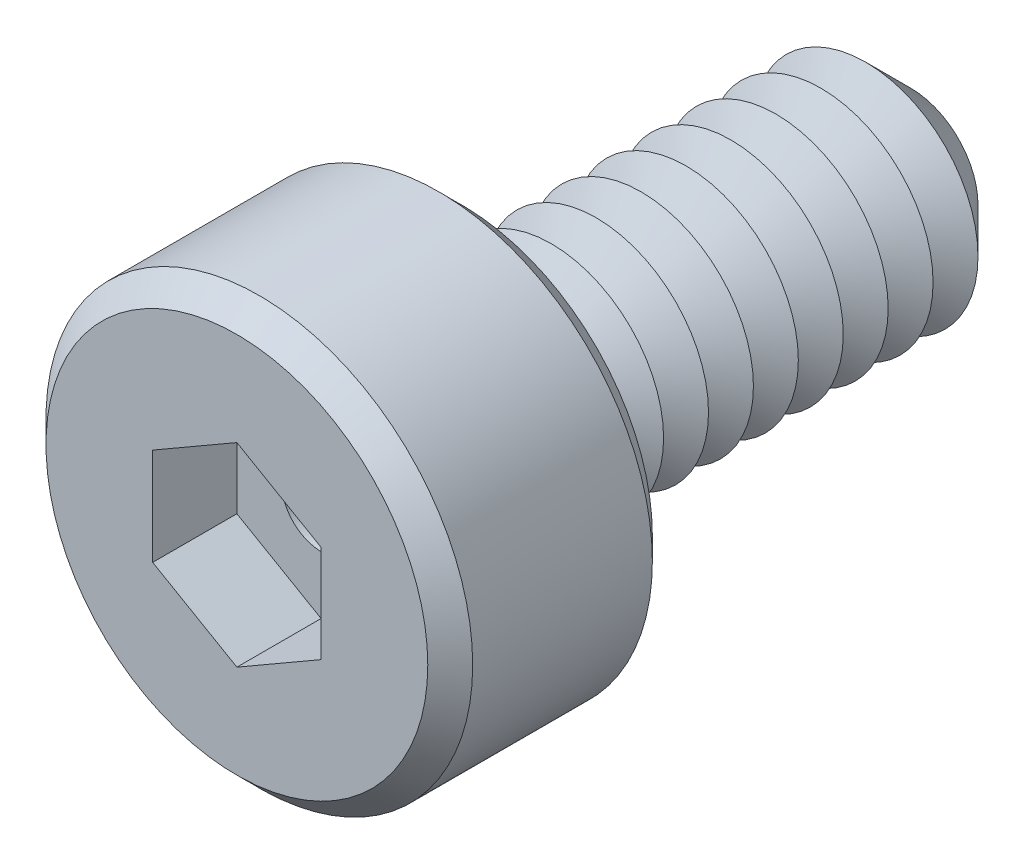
from build123d import *

# Parameters (mm, degrees)
SKETCH1_R           = 1.9
BOSS_EXTRUDE1_DEPTH = 2
SKETCH2_R           = 1
BOSS_EXTRUDE2_DEPTH = 4
CHAMFER1_SIZE       = 0.4
LPATTERN1_COUNT     = 9
LPATTERN1_PITCH     = 0.4
CUT_EXTRUDE1_DEPTH  = 0.75
SKETCH6_R           = 0.35
CUT_EXTRUDE2_DEPTH  = 5.25
CHAMFER2_SIZE       = 0.2


with BuildPart() as part:
    # Sketch1 → Boss-Extrude1 (new body)
    with BuildSketch(Plane.XY):
        Circle(SKETCH1_R)
    extrude(amount=BOSS_EXTRUDE1_DEPTH)

    # Sketch2 → Boss-Extrude2 (add)
    with BuildSketch(Plane(origin=(0, 0, 0), x_dir=(-1, 0, 0), z_dir=(0, 0, -1))):
        Circle(SKETCH2_R)
    extrude(amount=BOSS_EXTRUDE2_DEPTH)

    # Chamfer1
    chamfer1_edges = [part.edges().sort_by_distance(p)[0] for p in [
        (1, 0, -4),
    ]]
    chamfer(chamfer1_edges, length=CHAMFER1_SIZE)

    # Sketch4 → Cut-Revolve1 (revolve, cut)
    with BuildSketch(Plane(origin=(0, 0, 0), x_dir=(0, 0, -1), z_dir=(1, 0, 0)), mode=Mode.PRIVATE) as cut_revolve1_sk:
        Polygon((0, 1), (0.2, 0.653589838), (0.4, 1), align=None)
    cut_revolve1 = revolve(cut_revolve1_sk.sketch.rotate(Axis((0, 0, 2.512122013), (0, 0, -1)), 90), axis=Axis((0, 0, 2.512122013), (0, 0, -1)), mode=Mode.SUBTRACT)

    # LPattern1: Cut-Revolve1 ×9
    with Locations(*[(0, 0, -i * LPATTERN1_PITCH) for i in range(1, LPATTERN1_COUNT)]):
        add(cut_revolve1, mode=Mode.SUBTRACT)

    # Sketch5 → Cut-Extrude1 (cut)
    with BuildSketch(Plane.XY.offset(2)):
        Polygon((0, 0.866025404), (-0.75, 0.433012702), (-0.75, -0.433012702), (0, -0.866025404), (0.75, -0.433012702), (0.75, 0.433012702), align=None)
    extrude(amount=-CUT_EXTRUDE1_DEPTH, mode=Mode.SUBTRACT)

    # Sketch6 → Cut-Extrude2 (cut)
    with BuildSketch(Plane.XY.offset(1.25)):
        Circle(SKETCH6_R)
    extrude(amount=-CUT_EXTRUDE2_DEPTH, mode=Mode.SUBTRACT)

    # Chamfer2
    chamfer2_edges = [part.edges().sort_by_distance(p)[0] for p in [
        (-1.9, 0, 0),
        (-1.9, 0, 2),
    ]]
    chamfer(chamfer2_edges, length=CHAMFER2_SIZE)


solid = part.part
